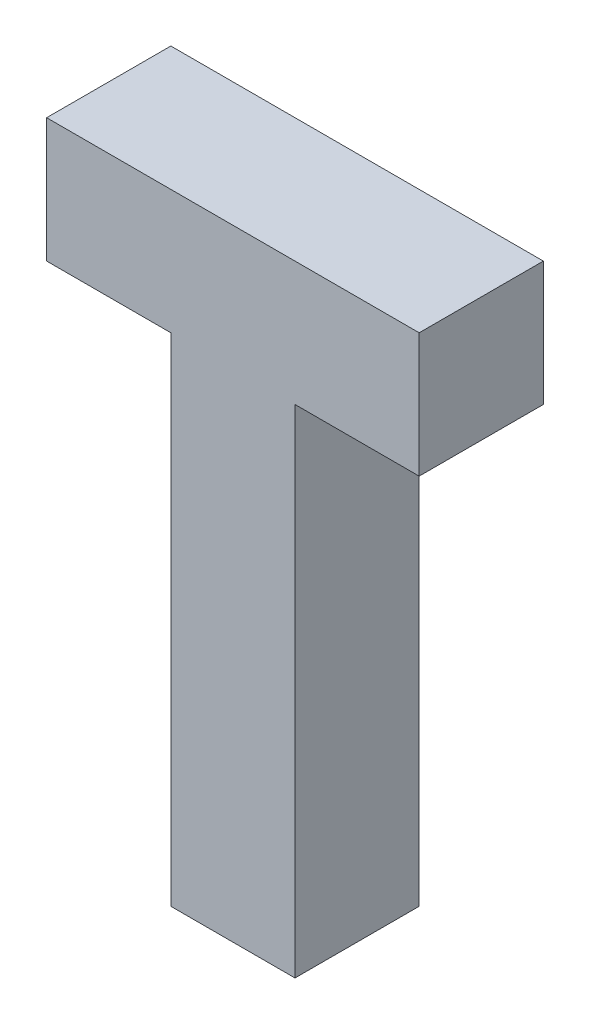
from build123d import *

# Parameters (mm, degrees)
BOSS_EXTRU_1_DEPTH = 10


with BuildPart() as part:
    # Esquisse1 → Boss.-Extru.1 (new body)
    with BuildSketch(Plane.XY):
        Polygon((10, 40), (20, 40), (20, 50), (-10, 50), (-10, 40), (0, 40), (0, 0), (10, 0), align=None)
    extrude(amount=BOSS_EXTRU_1_DEPTH)


solid = part.part
